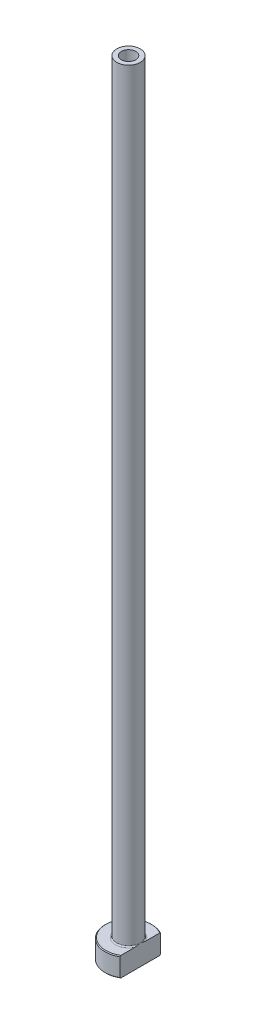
ISO-10303-21;
HEADER;
FILE_DESCRIPTION(('STEP AP214'),'2;1');
FILE_NAME('part.step','',(''),(''),'','','');
FILE_SCHEMA(('AUTOMOTIVE_DESIGN { 1 0 10303 214 1 1 1 1 }'));
ENDSEC;
DATA;
#1=APPLICATION_CONTEXT('core data for automotive mechanical design processes');
#2=APPLICATION_PROTOCOL_DEFINITION('international standard','automotive_design',2000,#1);
#3=PRODUCT_CONTEXT('',#1,'mechanical');
#4=PRODUCT('Part','Part','',(#3));
#5=PRODUCT_RELATED_PRODUCT_CATEGORY('part','',(#4));
#6=PRODUCT_DEFINITION_FORMATION('','',#4);
#7=PRODUCT_DEFINITION_CONTEXT('part definition',#1,'design');
#8=PRODUCT_DEFINITION('design','',#6,#7);
#9=PRODUCT_DEFINITION_SHAPE('','',#8);
#10=(LENGTH_UNIT() NAMED_UNIT(*) SI_UNIT(.MILLI.,.METRE.));
#11=(NAMED_UNIT(*) PLANE_ANGLE_UNIT() SI_UNIT($,.RADIAN.));
#12=(NAMED_UNIT(*) SI_UNIT($,.STERADIAN.) SOLID_ANGLE_UNIT());
#13=UNCERTAINTY_MEASURE_WITH_UNIT(LENGTH_MEASURE(1.E-05),#10,'distance_accuracy_value','');
#14=(GEOMETRIC_REPRESENTATION_CONTEXT(3) GLOBAL_UNCERTAINTY_ASSIGNED_CONTEXT((#13)) GLOBAL_UNIT_ASSIGNED_CONTEXT((#10,
#11,#12)) REPRESENTATION_CONTEXT('',''));
#15=CARTESIAN_POINT('',(0.,0.,0.));
#16=DIRECTION('',(0.,0.,1.));
#17=DIRECTION('',(1.,0.,0.));
#18=AXIS2_PLACEMENT_3D('',#15,#16,#17);
#19=CARTESIAN_POINT('',(0.,92.1876809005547,0.));
#20=DIRECTION('',(0.,1.,0.));
#21=DIRECTION('',(0.,0.,1.));
#22=AXIS2_PLACEMENT_3D('',#19,#20,#21);
#23=CYLINDRICAL_SURFACE('',#22,1.85);
#24=CARTESIAN_POINT('',(0.,200.,0.));
#25=DIRECTION('',(0.,1.,0.));
#26=DIRECTION('',(0.,0.,1.));
#27=AXIS2_PLACEMENT_3D('',#24,#25,#26);
#28=CIRCLE('',#27,1.85);
#29=CARTESIAN_POINT('',(0.,200.,1.85));
#30=VERTEX_POINT('',#29);
#31=EDGE_CURVE('E167',#30,#30,#28,.T.);
#32=ORIENTED_EDGE('',*,*,#31,.T.);
#33=EDGE_LOOP('',(#32));
#34=FACE_BOUND('',#33,.T.);
#35=CARTESIAN_POINT('',(0.,155.,0.));
#36=DIRECTION('',(0.,1.,0.));
#37=DIRECTION('',(0.,0.,1.));
#38=AXIS2_PLACEMENT_3D('',#35,#36,#37);
#39=CIRCLE('',#38,1.85);
#40=CARTESIAN_POINT('',(0.,155.,1.85));
#41=VERTEX_POINT('',#40);
#42=EDGE_CURVE('E170',#41,#41,#39,.T.);
#43=ORIENTED_EDGE('',*,*,#42,.F.);
#44=EDGE_LOOP('',(#43));
#45=FACE_BOUND('',#44,.T.);
#46=ADVANCED_FACE('F32',(#34,#45),#23,.F.);
#47=CARTESIAN_POINT('',(-1.85,200.,0.));
#48=DIRECTION('',(0.,1.,0.));
#49=DIRECTION('',(0.,0.,1.));
#50=AXIS2_PLACEMENT_3D('',#47,#48,#49);
#51=PLANE('',#50);
#52=CARTESIAN_POINT('',(0.,200.,0.));
#53=DIRECTION('',(0.,1.,0.));
#54=DIRECTION('',(0.,0.,1.));
#55=AXIS2_PLACEMENT_3D('',#52,#53,#54);
#56=CIRCLE('',#55,3.00000000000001);
#57=CARTESIAN_POINT('',(0.,200.,3.00000000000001));
#58=VERTEX_POINT('',#57);
#59=EDGE_CURVE('E174',#58,#58,#56,.T.);
#60=ORIENTED_EDGE('',*,*,#59,.T.);
#61=EDGE_LOOP('',(#60));
#62=FACE_BOUND('',#61,.T.);
#63=ORIENTED_EDGE('',*,*,#31,.F.);
#64=EDGE_LOOP('',(#63));
#65=FACE_BOUND('',#64,.T.);
#66=ADVANCED_FACE('F157',(#62,#65),#51,.T.);
#67=CARTESIAN_POINT('',(0.,92.1876809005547,0.));
#68=DIRECTION('',(0.,1.,0.));
#69=DIRECTION('',(0.,0.,1.));
#70=AXIS2_PLACEMENT_3D('',#67,#68,#69);
#71=CYLINDRICAL_SURFACE('',#70,3.);
#72=CARTESIAN_POINT('',(0.,5.3,0.));
#73=DIRECTION('',(0.,1.,0.));
#74=DIRECTION('',(0.,0.,1.));
#75=AXIS2_PLACEMENT_3D('',#72,#73,#74);
#76=CIRCLE('',#75,3.);
#77=CARTESIAN_POINT('',(3.,5.3,0.));
#78=VERTEX_POINT('',#77);
#79=EDGE_CURVE('E180',#78,#78,#76,.T.);
#80=ORIENTED_EDGE('',*,*,#79,.T.);
#81=EDGE_LOOP('',(#80));
#82=FACE_BOUND('',#81,.T.);
#83=ORIENTED_EDGE('',*,*,#59,.F.);
#84=EDGE_LOOP('',(#83));
#85=FACE_BOUND('',#84,.T.);
#86=ADVANCED_FACE('F162',(#82,#85),#71,.T.);
#87=CARTESIAN_POINT('',(-2.99999999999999,5.,0.));
#88=DIRECTION('',(0.,1.,0.));
#89=DIRECTION('',(0.,0.,1.));
#90=AXIS2_PLACEMENT_3D('',#87,#88,#89);
#91=PLANE('',#90);
#92=DIRECTION('',(0.,0.,1.));
#93=VECTOR('',#92,1.);
#94=CARTESIAN_POINT('',(2.99999999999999,5.,0.));
#95=LINE('',#94,#93);
#96=CARTESIAN_POINT('',(3.,5.,-4.96386945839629));
#97=VERTEX_POINT('',#96);
#98=CARTESIAN_POINT('',(2.99999999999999,5.,-1.37477270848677));
#99=VERTEX_POINT('',#98);
#100=EDGE_CURVE('E54',#97,#99,#95,.T.);
#101=ORIENTED_EDGE('',*,*,#100,.F.);
#102=CARTESIAN_POINT('',(0.,5.,0.));
#103=DIRECTION('',(0.,1.,0.));
#104=DIRECTION('',(0.,0.,1.));
#105=AXIS2_PLACEMENT_3D('',#102,#103,#104);
#106=CIRCLE('',#105,5.79999999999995);
#107=CARTESIAN_POINT('',(2.99999999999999,5.,4.96386945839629));
#108=VERTEX_POINT('',#107);
#109=EDGE_CURVE('E186',#97,#108,#106,.T.);
#110=ORIENTED_EDGE('',*,*,#109,.T.);
#111=CARTESIAN_POINT('',(2.99999999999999,5.,1.37477270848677));
#112=VERTEX_POINT('',#111);
#113=EDGE_CURVE('E134',#112,#108,#95,.T.);
#114=ORIENTED_EDGE('',*,*,#113,.F.);
#115=CARTESIAN_POINT('',(0.,5.,0.));
#116=DIRECTION('',(0.,1.,0.));
#117=DIRECTION('',(0.,0.,1.));
#118=AXIS2_PLACEMENT_3D('',#115,#116,#117);
#119=CIRCLE('',#118,3.3);
#120=EDGE_CURVE('E183',#112,#99,#119,.F.);
#121=ORIENTED_EDGE('',*,*,#120,.T.);
#122=EDGE_LOOP('',(#101,#110,#114,#121));
#123=FACE_BOUND('',#122,.T.);
#124=ADVANCED_FACE('F197',(#123),#91,.T.);
#125=CARTESIAN_POINT('',(0.,92.1876809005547,0.));
#126=DIRECTION('',(0.,1.,0.));
#127=DIRECTION('',(0.,0.,1.));
#128=AXIS2_PLACEMENT_3D('',#125,#126,#127);
#129=CYLINDRICAL_SURFACE('',#128,5.99999999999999);
#130=DIRECTION('',(0.,-1.,0.));
#131=VECTOR('',#130,1.);
#132=CARTESIAN_POINT('',(2.99999999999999,200.,5.19615242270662));
#133=LINE('',#132,#131);
#134=CARTESIAN_POINT('',(2.99999999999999,4.79999999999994,5.19615242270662));
#135=VERTEX_POINT('',#134);
#136=CARTESIAN_POINT('',(2.99999999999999,0.20000000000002,5.19615242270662));
#137=VERTEX_POINT('',#136);
#138=EDGE_CURVE('E82',#135,#137,#133,.T.);
#139=ORIENTED_EDGE('',*,*,#138,.F.);
#140=CARTESIAN_POINT('',(0.,4.79999999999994,0.));
#141=DIRECTION('',(0.,1.,0.));
#142=DIRECTION('',(0.,0.,1.));
#143=AXIS2_PLACEMENT_3D('',#140,#141,#142);
#144=CIRCLE('',#143,5.99999999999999);
#145=CARTESIAN_POINT('',(3.,4.79999999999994,-5.19615242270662));
#146=VERTEX_POINT('',#145);
#147=EDGE_CURVE('E95',#135,#146,#144,.F.);
#148=ORIENTED_EDGE('',*,*,#147,.T.);
#149=DIRECTION('',(0.,-1.,0.));
#150=VECTOR('',#149,1.);
#151=CARTESIAN_POINT('',(3.,200.,-5.19615242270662));
#152=LINE('',#151,#150);
#153=CARTESIAN_POINT('',(3.,0.20000000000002,-5.19615242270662));
#154=VERTEX_POINT('',#153);
#155=EDGE_CURVE('E192',#146,#154,#152,.T.);
#156=ORIENTED_EDGE('',*,*,#155,.T.);
#157=CARTESIAN_POINT('',(0.,0.20000000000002,0.));
#158=DIRECTION('',(0.,-1.,0.));
#159=DIRECTION('',(0.,0.,-1.));
#160=AXIS2_PLACEMENT_3D('',#157,#158,#159);
#161=CIRCLE('',#160,5.99999999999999);
#162=EDGE_CURVE('E98',#154,#137,#161,.F.);
#163=ORIENTED_EDGE('',*,*,#162,.T.);
#164=EDGE_LOOP('',(#139,#148,#156,#163));
#165=FACE_BOUND('',#164,.T.);
#166=ADVANCED_FACE('F190',(#165),#129,.T.);
#167=CARTESIAN_POINT('',(-5.99999999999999,0.,0.));
#168=DIRECTION('',(0.,-1.,0.));
#169=DIRECTION('',(0.,0.,-1.));
#170=AXIS2_PLACEMENT_3D('',#167,#168,#169);
#171=PLANE('',#170);
#172=CARTESIAN_POINT('',(0.,0.,0.));
#173=DIRECTION('',(0.,-1.,0.));
#174=DIRECTION('',(0.,0.,-1.));
#175=AXIS2_PLACEMENT_3D('',#172,#173,#174);
#176=CIRCLE('',#175,2.59999999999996);
#177=CARTESIAN_POINT('',(0.,0.,-2.59999999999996));
#178=VERTEX_POINT('',#177);
#179=EDGE_CURVE('E40',#178,#178,#176,.F.);
#180=ORIENTED_EDGE('',*,*,#179,.T.);
#181=EDGE_LOOP('',(#180));
#182=FACE_BOUND('',#181,.T.);
#183=DIRECTION('',(0.,0.,-1.));
#184=VECTOR('',#183,1.);
#185=CARTESIAN_POINT('',(2.99999999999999,0.,5.19615242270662));
#186=LINE('',#185,#184);
#187=CARTESIAN_POINT('',(2.99999999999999,0.,4.96386945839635));
#188=VERTEX_POINT('',#187);
#189=CARTESIAN_POINT('',(3.,0.,-4.96386945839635));
#190=VERTEX_POINT('',#189);
#191=EDGE_CURVE('E47',#188,#190,#186,.T.);
#192=ORIENTED_EDGE('',*,*,#191,.F.);
#193=CARTESIAN_POINT('',(0.,0.,0.));
#194=DIRECTION('',(0.,-1.,0.));
#195=DIRECTION('',(0.,0.,-1.));
#196=AXIS2_PLACEMENT_3D('',#193,#194,#195);
#197=CIRCLE('',#196,5.8);
#198=EDGE_CURVE('E92',#188,#190,#197,.T.);
#199=ORIENTED_EDGE('',*,*,#198,.T.);
#200=EDGE_LOOP('',(#192,#199));
#201=FACE_BOUND('',#200,.T.);
#202=ADVANCED_FACE('F91',(#182,#201),#171,.T.);
#203=CARTESIAN_POINT('',(0.,92.1876809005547,0.));
#204=DIRECTION('',(0.,1.,0.));
#205=DIRECTION('',(0.,0.,1.));
#206=AXIS2_PLACEMENT_3D('',#203,#204,#205);
#207=CYLINDRICAL_SURFACE('',#206,2.1);
#208=CARTESIAN_POINT('',(0.,0.499999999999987,0.));
#209=DIRECTION('',(0.,-1.,0.));
#210=DIRECTION('',(0.,0.,-1.));
#211=AXIS2_PLACEMENT_3D('',#208,#209,#210);
#212=CIRCLE('',#211,2.1);
#213=CARTESIAN_POINT('',(0.,0.499999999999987,-2.1));
#214=VERTEX_POINT('',#213);
#215=EDGE_CURVE('E11',#214,#214,#212,.T.);
#216=ORIENTED_EDGE('',*,*,#215,.T.);
#217=EDGE_LOOP('',(#216));
#218=FACE_BOUND('',#217,.T.);
#219=CARTESIAN_POINT('',(0.,143.,0.));
#220=DIRECTION('',(0.,1.,0.));
#221=DIRECTION('',(0.,0.,1.));
#222=AXIS2_PLACEMENT_3D('',#219,#220,#221);
#223=CIRCLE('',#222,2.10000000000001);
#224=CARTESIAN_POINT('',(0.,143.,2.10000000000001));
#225=VERTEX_POINT('',#224);
#226=EDGE_CURVE('E172',#225,#225,#223,.T.);
#227=ORIENTED_EDGE('',*,*,#226,.T.);
#228=EDGE_LOOP('',(#227));
#229=FACE_BOUND('',#228,.T.);
#230=ADVANCED_FACE('F215',(#218,#229),#207,.F.);
#231=CARTESIAN_POINT('',(0.,143.,0.));
#232=DIRECTION('',(0.,-1.,0.));
#233=DIRECTION('',(0.,0.,-1.));
#234=AXIS2_PLACEMENT_3D('',#231,#232,#233);
#235=CONICAL_SURFACE('',#234,2.10000000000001,0.0208303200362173);
#236=ORIENTED_EDGE('',*,*,#42,.T.);
#237=EDGE_LOOP('',(#236));
#238=FACE_BOUND('',#237,.T.);
#239=ORIENTED_EDGE('',*,*,#226,.F.);
#240=EDGE_LOOP('',(#239));
#241=FACE_BOUND('',#240,.T.);
#242=ADVANCED_FACE('F111',(#238,#241),#235,.F.);
#243=CARTESIAN_POINT('',(0.,5.3,0.));
#244=DIRECTION('',(0.,1.,0.));
#245=DIRECTION('',(0.,0.,1.));
#246=AXIS2_PLACEMENT_3D('',#243,#244,#245);
#247=TOROIDAL_SURFACE('',#246,3.3,0.3);
#248=ORIENTED_EDGE('',*,*,#120,.F.);
#249=CARTESIAN_POINT('',(3.,5.3,0.));
#250=CARTESIAN_POINT('',(3.,5.30000062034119,-1.12611837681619E-10));
#251=CARTESIAN_POINT('',(3.,5.30000124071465,1.7970684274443E-07));
#252=CARTESIAN_POINT('',(3.,5.30000241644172,7.12597634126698E-07));
#253=CARTESIAN_POINT('',(3.,5.30000296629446,1.07470919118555E-06));
#254=CARTESIAN_POINT('',(3.,5.30000408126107,1.93940838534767E-06));
#255=CARTESIAN_POINT('',(3.,5.30000463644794,2.45488632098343E-06));
#256=CARTESIAN_POINT('',(3.,5.30000565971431,3.54465568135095E-06));
#257=CARTESIAN_POINT('',(3.,5.30000612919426,4.11770712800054E-06));
#258=CARTESIAN_POINT('',(3.,5.30000778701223,6.25396510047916E-06));
#259=CARTESIAN_POINT('',(3.,5.30000888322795,7.89070925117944E-06));
#260=CARTESIAN_POINT('',(3.,5.30001076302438,1.11998061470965E-05));
#261=CARTESIAN_POINT('',(3.,5.30001156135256,1.28642120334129E-05));
#262=CARTESIAN_POINT('',(3.,5.30001474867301,1.96537185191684E-05));
#263=CARTESIAN_POINT('',(3.,5.30001702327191,2.48380256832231E-05));
#264=CARTESIAN_POINT('',(3.,5.30002052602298,3.48178503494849E-05));
#265=CARTESIAN_POINT('',(3.,5.30002184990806,3.95800645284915E-05));
#266=CARTESIAN_POINT('',(2.99999999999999,5.3000312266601,7.41814409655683E-05));
#267=CARTESIAN_POINT('',(2.99999999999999,5.30003808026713,0.000104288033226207));
#268=CARTESIAN_POINT('',(3.,5.30006804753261,0.00022223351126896));
#269=CARTESIAN_POINT('',(2.99999999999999,5.30009687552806,0.000308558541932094));
#270=CARTESIAN_POINT('',(2.99999999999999,5.30020809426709,0.000648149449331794));
#271=CARTESIAN_POINT('',(2.99999999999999,5.30028657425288,0.000902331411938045));
#272=CARTESIAN_POINT('',(3.,5.30059876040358,0.00190491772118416));
#273=CARTESIAN_POINT('',(2.99999999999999,5.30083723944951,0.00265218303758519));
#274=CARTESIAN_POINT('',(2.99999999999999,5.30182192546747,0.00574694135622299));
#275=CARTESIAN_POINT('',(2.99999999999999,5.30256224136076,0.00809584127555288));
#276=CARTESIAN_POINT('',(3.,5.31160267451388,0.0367678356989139));
#277=CARTESIAN_POINT('',(3.,5.31993817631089,0.0630827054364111));
#278=CARTESIAN_POINT('',(2.99999999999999,5.33621504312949,0.114704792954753));
#279=CARTESIAN_POINT('',(2.99999999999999,5.34415908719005,0.140011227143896));
#280=CARTESIAN_POINT('',(3.,5.3609438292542,0.193774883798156));
#281=CARTESIAN_POINT('',(2.99999999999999,5.36977415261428,0.222235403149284));
#282=CARTESIAN_POINT('',(2.99999999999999,5.38736474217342,0.27951240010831));
#283=CARTESIAN_POINT('',(2.99999999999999,5.39612323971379,0.308329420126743));
#284=CARTESIAN_POINT('',(2.99999999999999,5.41726575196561,0.378880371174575));
#285=CARTESIAN_POINT('',(2.99999999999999,5.42952723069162,0.420651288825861));
#286=CARTESIAN_POINT('',(2.99999999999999,5.4530959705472,0.503357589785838));
#287=CARTESIAN_POINT('',(2.99999999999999,5.46441924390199,0.544288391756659));
#288=CARTESIAN_POINT('',(2.99999999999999,5.48778169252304,0.63215617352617));
#289=CARTESIAN_POINT('',(2.99999999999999,5.49969678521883,0.679126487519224));
#290=CARTESIAN_POINT('',(2.99999999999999,5.52221484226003,0.77374095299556));
#291=CARTESIAN_POINT('',(2.99999999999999,5.53280772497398,0.821387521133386));
#292=CARTESIAN_POINT('',(2.99999999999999,5.55291503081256,0.920589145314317));
#293=CARTESIAN_POINT('',(2.99999999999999,5.56229188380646,0.972172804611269));
#294=CARTESIAN_POINT('',(2.99999999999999,5.57838694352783,1.07574836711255));
#295=CARTESIAN_POINT('',(2.99999999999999,5.585105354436,1.12774023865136));
#296=CARTESIAN_POINT('',(2.99999999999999,5.59681427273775,1.24924411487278));
#297=CARTESIAN_POINT('',(2.99999999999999,5.60051317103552,1.31890364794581));
#298=CARTESIAN_POINT('',(2.99999999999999,5.59966579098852,1.42270835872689));
#299=CARTESIAN_POINT('',(2.99999999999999,5.59835823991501,1.45688093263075));
#300=CARTESIAN_POINT('',(2.99999999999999,5.59322745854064,1.52502533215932));
#301=CARTESIAN_POINT('',(2.99999999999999,5.58940645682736,1.55899730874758));
#302=CARTESIAN_POINT('',(2.99999999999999,5.57976146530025,1.61947815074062));
#303=CARTESIAN_POINT('',(2.99999999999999,5.57451506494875,1.64607760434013));
#304=CARTESIAN_POINT('',(2.99999999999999,5.56161153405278,1.69883648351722));
#305=CARTESIAN_POINT('',(2.99999999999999,5.55394338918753,1.72499331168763));
#306=CARTESIAN_POINT('',(2.99999999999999,5.53555176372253,1.77650913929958));
#307=CARTESIAN_POINT('',(2.99999999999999,5.52480031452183,1.80185836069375));
#308=CARTESIAN_POINT('',(2.99999999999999,5.49948027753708,1.85054545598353));
#309=CARTESIAN_POINT('',(2.99999999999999,5.48493141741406,1.87389291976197));
#310=CARTESIAN_POINT('',(2.99999999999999,5.45992470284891,1.90552135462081));
#311=CARTESIAN_POINT('',(2.99999999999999,5.45133318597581,1.91527363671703));
#312=CARTESIAN_POINT('',(2.99999999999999,5.43294163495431,1.93360072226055));
#313=CARTESIAN_POINT('',(2.99999999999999,5.42314083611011,1.94217477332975));
#314=CARTESIAN_POINT('',(2.99999999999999,5.4021589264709,1.95778354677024));
#315=CARTESIAN_POINT('',(2.99999999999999,5.39096156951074,1.96479687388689));
#316=CARTESIAN_POINT('',(2.99999999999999,5.36742144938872,1.97652218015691));
#317=CARTESIAN_POINT('',(2.99999999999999,5.35508207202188,1.98124071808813));
#318=CARTESIAN_POINT('',(2.99999999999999,5.33320117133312,1.98690185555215));
#319=CARTESIAN_POINT('',(2.99999999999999,5.32383559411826,1.98852953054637));
#320=CARTESIAN_POINT('',(2.99999999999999,5.30496375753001,1.99016898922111));
#321=CARTESIAN_POINT('',(2.99999999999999,5.29545756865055,1.99018155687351));
#322=CARTESIAN_POINT('',(2.99999999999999,5.2765931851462,1.98858978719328));
#323=CARTESIAN_POINT('',(2.99999999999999,5.26723486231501,1.98698693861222));
#324=CARTESIAN_POINT('',(2.99999999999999,5.24889957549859,1.98229727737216));
#325=CARTESIAN_POINT('',(2.99999999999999,5.23992286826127,1.97920948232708));
#326=CARTESIAN_POINT('',(2.99999999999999,5.2198129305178,1.97059641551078));
#327=CARTESIAN_POINT('',(2.99999999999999,5.2088771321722,1.96461176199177));
#328=CARTESIAN_POINT('',(2.99999999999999,5.18811536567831,1.9509572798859));
#329=CARTESIAN_POINT('',(2.99999999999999,5.1782917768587,1.94328393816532));
#330=CARTESIAN_POINT('',(2.99999999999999,5.15512177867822,1.92254223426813));
#331=CARTESIAN_POINT('',(2.99999999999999,5.1424756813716,1.9086968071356));
#332=CARTESIAN_POINT('',(2.99999999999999,5.11944595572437,1.87927587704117));
#333=CARTESIAN_POINT('',(2.99999999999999,5.10906527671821,1.86369815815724));
#334=CARTESIAN_POINT('',(2.99999999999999,5.0830960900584,1.81927355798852));
#335=CARTESIAN_POINT('',(2.99999999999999,5.06948546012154,1.78928084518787));
#336=CARTESIAN_POINT('',(2.99999999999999,5.04658664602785,1.72751962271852));
#337=CARTESIAN_POINT('',(2.99999999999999,5.03733582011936,1.69573828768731));
#338=CARTESIAN_POINT('',(2.99999999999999,5.0221431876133,1.630799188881));
#339=CARTESIAN_POINT('',(2.99999999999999,5.01626537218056,1.59762686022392));
#340=CARTESIAN_POINT('',(2.99999999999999,5.00734002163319,1.53086029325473));
#341=CARTESIAN_POINT('',(2.99999999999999,5.00429797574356,1.49726536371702));
#342=CARTESIAN_POINT('',(2.99999999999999,5.00059037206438,1.43100872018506));
#343=CARTESIAN_POINT('',(2.99999999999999,4.99985343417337,1.39835069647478));
#344=CARTESIAN_POINT('',(2.99999999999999,5.00019322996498,1.33318312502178));
#345=CARTESIAN_POINT('',(2.99999999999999,5.00126261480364,1.3006735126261));
#346=CARTESIAN_POINT('',(2.99999999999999,5.00569854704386,1.22190465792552));
#347=CARTESIAN_POINT('',(2.99999999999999,5.00984986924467,1.1756903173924));
#348=CARTESIAN_POINT('',(2.99999999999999,5.02060876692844,1.08357061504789));
#349=CARTESIAN_POINT('',(2.99999999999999,5.02721586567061,1.03766519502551));
#350=CARTESIAN_POINT('',(2.99999999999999,5.0425809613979,0.945130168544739));
#351=CARTESIAN_POINT('',(2.99999999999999,5.05138514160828,0.898508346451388));
#352=CARTESIAN_POINT('',(2.99999999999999,5.07066869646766,0.805496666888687));
#353=CARTESIAN_POINT('',(2.99999999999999,5.08115218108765,0.759107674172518));
#354=CARTESIAN_POINT('',(2.99999999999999,5.10738921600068,0.650207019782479));
#355=CARTESIAN_POINT('',(2.99999999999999,5.12369110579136,0.58782843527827));
#356=CARTESIAN_POINT('',(2.99999999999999,5.15777680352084,0.464212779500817));
#357=CARTESIAN_POINT('',(2.99999999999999,5.1755426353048,0.402970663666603));
#358=CARTESIAN_POINT('',(2.99999999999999,5.2100672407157,0.287596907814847));
#359=CARTESIAN_POINT('',(3.,5.22671796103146,0.233432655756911));
#360=CARTESIAN_POINT('',(2.99999999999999,5.25241226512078,0.150940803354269));
#361=CARTESIAN_POINT('',(2.99999999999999,5.2613106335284,0.122567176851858));
#362=CARTESIAN_POINT('',(3.,5.2790517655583,0.0662804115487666));
#363=CARTESIAN_POINT('',(3.,5.28789327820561,0.038366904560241));
#364=CARTESIAN_POINT('',(2.99999999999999,5.29743877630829,0.0080925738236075));
#365=CARTESIAN_POINT('',(2.99999999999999,5.29818012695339,0.00574041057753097));
#366=CARTESIAN_POINT('',(2.99999999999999,5.2991650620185,0.00264489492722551));
#367=CARTESIAN_POINT('',(3.,5.29940274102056,0.00190013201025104));
#368=CARTESIAN_POINT('',(2.99999999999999,5.29971394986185,0.000900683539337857));
#369=CARTESIAN_POINT('',(2.99999999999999,5.29979223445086,0.000647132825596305));
#370=CARTESIAN_POINT('',(2.99999999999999,5.29990321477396,0.000308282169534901));
#371=CARTESIAN_POINT('',(3.,5.29993200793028,0.000222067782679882));
#372=CARTESIAN_POINT('',(2.99999999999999,5.29996194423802,0.000104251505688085));
#373=CARTESIAN_POINT('',(2.99999999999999,5.29996879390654,7.41614246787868E-05));
#374=CARTESIAN_POINT('',(3.,5.29997816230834,3.95766708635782E-05));
#375=CARTESIAN_POINT('',(3.,5.29997948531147,3.48154668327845E-05));
#376=CARTESIAN_POINT('',(3.,5.29998298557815,2.48376281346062E-05));
#377=CARTESIAN_POINT('',(3.,5.29998525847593,1.96542453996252E-05));
#378=CARTESIAN_POINT('',(3.,5.2999884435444,1.28656655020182E-05));
#379=CARTESIAN_POINT('',(3.,5.29998924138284,1.12013349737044E-05));
#380=CARTESIAN_POINT('',(3.,5.2999911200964,7.89230029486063E-06));
#381=CARTESIAN_POINT('',(3.,5.29999221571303,6.25553534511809E-06));
#382=CARTESIAN_POINT('',(3.,5.29999387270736,4.11914367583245E-06));
#383=CARTESIAN_POINT('',(3.,5.29999434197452,3.54603094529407E-06));
#384=CARTESIAN_POINT('',(3.,5.29999536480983,2.45610068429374E-06));
#385=CARTESIAN_POINT('',(3.,5.29999591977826,1.94052228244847E-06));
#386=CARTESIAN_POINT('',(3.,5.29999703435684,1.07558323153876E-06));
#387=CARTESIAN_POINT('',(3.,5.29999758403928,7.13339443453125E-07));
#388=CARTESIAN_POINT('',(3.,5.29999875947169,1.80121939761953E-07));
#389=CARTESIAN_POINT('',(3.,5.29999937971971,1.12601282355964E-10));
#390=CARTESIAN_POINT('',(3.,5.3,0.));
#391=B_SPLINE_CURVE_WITH_KNOTS('',3,(#249,#250,#251,#252,#253,#254,#255,#256,#257,#258,#259,
#260,#261,#262,#263,#264,#265,#266,#267,#268,#269,#270,#271,#272,#273,#274,#275,#276,#277,#278,
#279,#280,#281,#282,#283,#284,#285,#286,#287,#288,#289,#290,#291,#292,#293,#294,#295,#296,#297,
#298,#299,#300,#301,#302,#303,#304,#305,#306,#307,#308,#309,#310,#311,#312,#313,#314,#315,#316,
#317,#318,#319,#320,#321,#322,#323,#324,#325,#326,#327,#328,#329,#330,#331,#332,#333,#334,#335,
#336,#337,#338,#339,#340,#341,#342,#343,#344,#345,#346,#347,#348,#349,#350,#351,#352,#353,#354,
#355,#356,#357,#358,#359,#360,#361,#362,#363,#364,#365,#366,#367,#368,#369,#370,#371,#372,#373,
#374,#375,#376,#377,#378,#379,#380,#381,#382,#383,#384,#385,#386,#387,#388,#389,#390),
.UNSPECIFIED.,.T.,.F.,(4,2,2,2,2,2,2,2,2,2,2,2,2,2,2,2,2,2,2,2,2,2,2,2,2,2,2,2,2,2,2,2,2,2,2,2,
2,2,2,2,2,2,2,2,2,2,2,2,2,2,2,2,2,2,2,2,2,2,2,2,2,2,2,2,2,2,2,2,2,2,4),(0.,1.8651383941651E-06,
3.83353199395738E-06,6.09513173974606E-06,8.31560460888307E-06,1.42000689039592E-05,
1.97335486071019E-05,3.66769850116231E-05,5.14858298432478E-05,0.000144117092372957,
0.000416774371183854,0.00121521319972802,0.00356794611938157,0.0109568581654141,
0.0937636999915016,0.173336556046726,0.262732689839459,0.353088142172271,0.483684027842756,
0.611082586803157,0.756439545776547,0.902844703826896,1.06007042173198,1.2172840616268,
1.42611662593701,1.52864191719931,1.63107642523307,1.71232857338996,1.79395571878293,
1.87634808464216,1.95832065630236,1.99722769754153,2.03615946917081,2.07559591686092,
2.11491897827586,2.14330913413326,2.17168550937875,2.20003575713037,2.22840478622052,
2.26559554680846,2.30286442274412,2.3588021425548,2.41481225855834,2.5130700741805,
2.61215518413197,2.71306273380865,2.81416520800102,2.91210427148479,3.00964583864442,
3.14875779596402,3.28784276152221,3.43014232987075,3.57279564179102,3.76617940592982,
3.95746724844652,4.12746077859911,4.21667041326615,4.30450746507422,4.31190664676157,
4.31425150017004,4.31504795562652,4.31532026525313,4.31541284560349,4.31542765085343,
4.3154445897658,4.31545012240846,4.31545600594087,4.31545822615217,4.3154604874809,
4.31546245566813,4.31546432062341),.UNSPECIFIED.);
#392=EDGE_CURVE('E126',#112,#78,#391,.T.);
#393=ORIENTED_EDGE('',*,*,#392,.T.);
#394=ORIENTED_EDGE('',*,*,#79,.F.);
#395=CARTESIAN_POINT('',(3.,5.3,0.));
#396=CARTESIAN_POINT('',(3.,5.29999937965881,1.12612407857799E-10));
#397=CARTESIAN_POINT('',(3.,5.29999875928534,-1.7970684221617E-07));
#398=CARTESIAN_POINT('',(3.,5.29999758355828,-7.12597633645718E-07));
#399=CARTESIAN_POINT('',(3.,5.29999703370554,-1.07470919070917E-06));
#400=CARTESIAN_POINT('',(3.,5.29999591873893,-1.93940838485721E-06));
#401=CARTESIAN_POINT('',(3.,5.29999536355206,-2.45488632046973E-06));
#402=CARTESIAN_POINT('',(3.,5.29999434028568,-3.54465568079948E-06));
#403=CARTESIAN_POINT('',(3.,5.29999387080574,-4.11770712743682E-06));
#404=CARTESIAN_POINT('',(3.,5.29999221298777,-6.25396509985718E-06));
#405=CARTESIAN_POINT('',(3.,5.29999111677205,-7.89070925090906E-06));
#406=CARTESIAN_POINT('',(3.,5.29998923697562,-1.11998061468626E-05));
#407=CARTESIAN_POINT('',(3.,5.29998843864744,-1.28642120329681E-05));
#408=CARTESIAN_POINT('',(3.,5.29998525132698,-1.96537185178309E-05));
#409=CARTESIAN_POINT('',(3.,5.29998297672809,-2.4838025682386E-05));
#410=CARTESIAN_POINT('',(3.,5.29997947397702,-3.48178503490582E-05));
#411=CARTESIAN_POINT('',(3.,5.29997815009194,-3.95800645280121E-05));
#412=CARTESIAN_POINT('',(2.99999999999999,5.2999687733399,-7.41814409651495E-05));
#413=CARTESIAN_POINT('',(2.99999999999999,5.29996191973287,-0.000104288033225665));
#414=CARTESIAN_POINT('',(3.,5.29993195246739,-0.000222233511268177));
#415=CARTESIAN_POINT('',(2.99999999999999,5.29990312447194,-0.000308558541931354));
#416=CARTESIAN_POINT('',(2.99999999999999,5.29979190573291,-0.000648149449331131));
#417=CARTESIAN_POINT('',(2.99999999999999,5.29971342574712,-0.00090233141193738));
#418=CARTESIAN_POINT('',(3.,5.29940123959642,-0.00190491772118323));
#419=CARTESIAN_POINT('',(2.99999999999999,5.29916276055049,-0.00265218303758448));
#420=CARTESIAN_POINT('',(2.99999999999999,5.29817807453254,-0.00574694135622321));
#421=CARTESIAN_POINT('',(2.99999999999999,5.29743775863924,-0.00809584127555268));
#422=CARTESIAN_POINT('',(3.,5.2883973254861,-0.0367678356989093));
#423=CARTESIAN_POINT('',(3.,5.2800618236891,-0.0630827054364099));
#424=CARTESIAN_POINT('',(2.99999999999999,5.26378495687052,-0.114704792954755));
#425=CARTESIAN_POINT('',(2.99999999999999,5.25584091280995,-0.140011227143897));
#426=CARTESIAN_POINT('',(3.,5.23905617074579,-0.193774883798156));
#427=CARTESIAN_POINT('',(2.99999999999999,5.23022584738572,-0.222235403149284));
#428=CARTESIAN_POINT('',(2.99999999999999,5.21263525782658,-0.27951240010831));
#429=CARTESIAN_POINT('',(2.99999999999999,5.2038767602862,-0.308329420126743));
#430=CARTESIAN_POINT('',(2.99999999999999,5.18273424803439,-0.378880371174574));
#431=CARTESIAN_POINT('',(2.99999999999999,5.17047276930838,-0.42065128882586));
#432=CARTESIAN_POINT('',(2.99999999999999,5.1469040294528,-0.503357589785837));
#433=CARTESIAN_POINT('',(2.99999999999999,5.13558075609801,-0.544288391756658));
#434=CARTESIAN_POINT('',(2.99999999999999,5.11221830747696,-0.63215617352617));
#435=CARTESIAN_POINT('',(2.99999999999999,5.10030321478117,-0.679126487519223));
#436=CARTESIAN_POINT('',(2.99999999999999,5.07778515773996,-0.773740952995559));
#437=CARTESIAN_POINT('',(2.99999999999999,5.06719227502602,-0.821387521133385));
#438=CARTESIAN_POINT('',(2.99999999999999,5.04708496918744,-0.920589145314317));
#439=CARTESIAN_POINT('',(2.99999999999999,5.03770811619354,-0.972172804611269));
#440=CARTESIAN_POINT('',(2.99999999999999,5.02161305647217,-1.07574836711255));
#441=CARTESIAN_POINT('',(2.99999999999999,5.014894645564,-1.12774023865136));
#442=CARTESIAN_POINT('',(2.99999999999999,5.00318572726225,-1.24924411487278));
#443=CARTESIAN_POINT('',(2.99999999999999,4.99948682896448,-1.31890364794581));
#444=CARTESIAN_POINT('',(2.99999999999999,5.00033420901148,-1.42270835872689));
#445=CARTESIAN_POINT('',(2.99999999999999,5.00164176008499,-1.45688093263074));
#446=CARTESIAN_POINT('',(2.99999999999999,5.00677254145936,-1.52502533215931));
#447=CARTESIAN_POINT('',(2.99999999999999,5.01059354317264,-1.55899730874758));
#448=CARTESIAN_POINT('',(2.99999999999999,5.02023853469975,-1.61947815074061));
#449=CARTESIAN_POINT('',(2.99999999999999,5.02548493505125,-1.64607760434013));
#450=CARTESIAN_POINT('',(2.99999999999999,5.03838846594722,-1.69883648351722));
#451=CARTESIAN_POINT('',(2.99999999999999,5.04605661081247,-1.72499331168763));
#452=CARTESIAN_POINT('',(2.99999999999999,5.06444823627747,-1.77650913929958));
#453=CARTESIAN_POINT('',(2.99999999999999,5.07519968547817,-1.80185836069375));
#454=CARTESIAN_POINT('',(2.99999999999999,5.10051972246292,-1.85054545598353));
#455=CARTESIAN_POINT('',(2.99999999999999,5.11506858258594,-1.87389291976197));
#456=CARTESIAN_POINT('',(2.99999999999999,5.14007529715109,-1.90552135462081));
#457=CARTESIAN_POINT('',(2.99999999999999,5.14866681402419,-1.91527363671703));
#458=CARTESIAN_POINT('',(2.99999999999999,5.16705836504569,-1.93360072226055));
#459=CARTESIAN_POINT('',(2.99999999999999,5.17685916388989,-1.94217477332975));
#460=CARTESIAN_POINT('',(2.99999999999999,5.1978410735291,-1.95778354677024));
#461=CARTESIAN_POINT('',(2.99999999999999,5.20903843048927,-1.96479687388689));
#462=CARTESIAN_POINT('',(2.99999999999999,5.23257855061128,-1.97652218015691));
#463=CARTESIAN_POINT('',(2.99999999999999,5.24491792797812,-1.98124071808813));
#464=CARTESIAN_POINT('',(2.99999999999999,5.26679882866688,-1.98690185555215));
#465=CARTESIAN_POINT('',(2.99999999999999,5.27616440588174,-1.98852953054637));
#466=CARTESIAN_POINT('',(2.99999999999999,5.29503624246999,-1.99016898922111));
#467=CARTESIAN_POINT('',(2.99999999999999,5.30454243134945,-1.9901815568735));
#468=CARTESIAN_POINT('',(2.99999999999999,5.3234068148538,-1.98858978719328));
#469=CARTESIAN_POINT('',(2.99999999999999,5.33276513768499,-1.98698693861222));
#470=CARTESIAN_POINT('',(2.99999999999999,5.35110042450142,-1.98229727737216));
#471=CARTESIAN_POINT('',(2.99999999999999,5.36007713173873,-1.97920948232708));
#472=CARTESIAN_POINT('',(2.99999999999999,5.3801870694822,-1.97059641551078));
#473=CARTESIAN_POINT('',(2.99999999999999,5.3911228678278,-1.96461176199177));
#474=CARTESIAN_POINT('',(2.99999999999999,5.41188463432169,-1.9509572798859));
#475=CARTESIAN_POINT('',(2.99999999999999,5.4217082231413,-1.94328393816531));
#476=CARTESIAN_POINT('',(2.99999999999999,5.44487822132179,-1.92254223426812));
#477=CARTESIAN_POINT('',(2.99999999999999,5.45752431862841,-1.9086968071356));
#478=CARTESIAN_POINT('',(2.99999999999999,5.48055404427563,-1.87927587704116));
#479=CARTESIAN_POINT('',(2.99999999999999,5.49093472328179,-1.86369815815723));
#480=CARTESIAN_POINT('',(2.99999999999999,5.51690390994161,-1.8192735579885));
#481=CARTESIAN_POINT('',(2.99999999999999,5.53051453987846,-1.78928084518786));
#482=CARTESIAN_POINT('',(2.99999999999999,5.55341335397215,-1.7275196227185));
#483=CARTESIAN_POINT('',(2.99999999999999,5.56266417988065,-1.69573828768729));
#484=CARTESIAN_POINT('',(2.99999999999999,5.57785681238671,-1.63079918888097));
#485=CARTESIAN_POINT('',(2.99999999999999,5.58373462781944,-1.59762686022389));
#486=CARTESIAN_POINT('',(2.99999999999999,5.59265997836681,-1.53086029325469));
#487=CARTESIAN_POINT('',(2.99999999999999,5.59570202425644,-1.49726536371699));
#488=CARTESIAN_POINT('',(2.99999999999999,5.59940962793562,-1.43100872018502));
#489=CARTESIAN_POINT('',(2.99999999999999,5.60014656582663,-1.39835069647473));
#490=CARTESIAN_POINT('',(2.99999999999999,5.59980677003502,-1.33318312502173));
#491=CARTESIAN_POINT('',(2.99999999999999,5.59873738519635,-1.30067351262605));
#492=CARTESIAN_POINT('',(2.99999999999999,5.59430145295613,-1.22190465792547));
#493=CARTESIAN_POINT('',(2.99999999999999,5.59015013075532,-1.17569031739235));
#494=CARTESIAN_POINT('',(2.99999999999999,5.57939123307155,-1.08357061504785));
#495=CARTESIAN_POINT('',(2.99999999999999,5.57278413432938,-1.03766519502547));
#496=CARTESIAN_POINT('',(2.99999999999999,5.55741903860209,-0.945130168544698));
#497=CARTESIAN_POINT('',(2.99999999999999,5.5486148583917,-0.898508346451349));
#498=CARTESIAN_POINT('',(2.99999999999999,5.52933130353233,-0.805496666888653));
#499=CARTESIAN_POINT('',(2.99999999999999,5.51884781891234,-0.759107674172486));
#500=CARTESIAN_POINT('',(2.99999999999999,5.49261078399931,-0.650207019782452));
#501=CARTESIAN_POINT('',(2.99999999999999,5.47630889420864,-0.587828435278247));
#502=CARTESIAN_POINT('',(2.99999999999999,5.44222319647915,-0.464212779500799));
#503=CARTESIAN_POINT('',(2.99999999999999,5.42445736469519,-0.402970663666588));
#504=CARTESIAN_POINT('',(2.99999999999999,5.3899327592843,-0.287596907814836));
#505=CARTESIAN_POINT('',(3.,5.37328203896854,-0.2334326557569));
#506=CARTESIAN_POINT('',(2.99999999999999,5.34758773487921,-0.150940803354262));
#507=CARTESIAN_POINT('',(2.99999999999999,5.33868936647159,-0.122567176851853));
#508=CARTESIAN_POINT('',(3.,5.32094823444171,-0.0662804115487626));
#509=CARTESIAN_POINT('',(3.,5.3121067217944,-0.0383669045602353));
#510=CARTESIAN_POINT('',(2.99999999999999,5.30256122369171,-0.0080925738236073));
#511=CARTESIAN_POINT('',(2.99999999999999,5.30181987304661,-0.00574041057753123));
#512=CARTESIAN_POINT('',(2.99999999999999,5.3008349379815,-0.0026448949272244));
#513=CARTESIAN_POINT('',(3.,5.30059725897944,-0.00190013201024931));
#514=CARTESIAN_POINT('',(2.99999999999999,5.30028605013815,-0.000900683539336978));
#515=CARTESIAN_POINT('',(2.99999999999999,5.30020776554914,-0.000647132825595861));
#516=CARTESIAN_POINT('',(2.99999999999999,5.30009678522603,-0.000308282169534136));
#517=CARTESIAN_POINT('',(3.,5.30006799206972,-0.000222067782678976));
#518=CARTESIAN_POINT('',(2.99999999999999,5.30003805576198,-0.000104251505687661));
#519=CARTESIAN_POINT('',(2.99999999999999,5.30003120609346,-7.41614246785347E-05));
#520=CARTESIAN_POINT('',(3.,5.30002183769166,-3.9576670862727E-05));
#521=CARTESIAN_POINT('',(3.,5.30002051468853,-3.48154668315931E-05));
#522=CARTESIAN_POINT('',(3.,5.30001701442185,-2.48376281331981E-05));
#523=CARTESIAN_POINT('',(3.,5.30001474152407,-1.96542453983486E-05));
#524=CARTESIAN_POINT('',(3.,5.3000115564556,-1.28656655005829E-05));
#525=CARTESIAN_POINT('',(3.,5.30001075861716,-1.12013349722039E-05));
#526=CARTESIAN_POINT('',(3.,5.3000088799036,-7.89230029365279E-06));
#527=CARTESIAN_POINT('',(3.,5.30000778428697,-6.25553534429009E-06));
#528=CARTESIAN_POINT('',(3.,5.30000612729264,-4.11914367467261E-06));
#529=CARTESIAN_POINT('',(3.,5.30000565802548,-3.54603094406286E-06));
#530=CARTESIAN_POINT('',(3.,5.30000463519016,-2.4561006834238E-06));
#531=CARTESIAN_POINT('',(3.,5.30000408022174,-1.94052228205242E-06));
#532=CARTESIAN_POINT('',(3.,5.30000296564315,-1.0755832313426E-06));
#533=CARTESIAN_POINT('',(3.,5.30000241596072,-7.13339443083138E-07));
#534=CARTESIAN_POINT('',(3.,5.3000012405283,-1.80121939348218E-07));
#535=CARTESIAN_POINT('',(3.,5.30000062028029,-1.12600850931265E-10));
#536=CARTESIAN_POINT('',(3.,5.3,0.));
#537=B_SPLINE_CURVE_WITH_KNOTS('',3,(#395,#396,#397,#398,#399,#400,#401,#402,#403,#404,#405,
#406,#407,#408,#409,#410,#411,#412,#413,#414,#415,#416,#417,#418,#419,#420,#421,#422,#423,#424,
#425,#426,#427,#428,#429,#430,#431,#432,#433,#434,#435,#436,#437,#438,#439,#440,#441,#442,#443,
#444,#445,#446,#447,#448,#449,#450,#451,#452,#453,#454,#455,#456,#457,#458,#459,#460,#461,#462,
#463,#464,#465,#466,#467,#468,#469,#470,#471,#472,#473,#474,#475,#476,#477,#478,#479,#480,#481,
#482,#483,#484,#485,#486,#487,#488,#489,#490,#491,#492,#493,#494,#495,#496,#497,#498,#499,#500,
#501,#502,#503,#504,#505,#506,#507,#508,#509,#510,#511,#512,#513,#514,#515,#516,#517,#518,#519,
#520,#521,#522,#523,#524,#525,#526,#527,#528,#529,#530,#531,#532,#533,#534,#535,#536),
.UNSPECIFIED.,.T.,.F.,(4,2,2,2,2,2,2,2,2,2,2,2,2,2,2,2,2,2,2,2,2,2,2,2,2,2,2,2,2,2,2,2,2,2,2,2,
2,2,2,2,2,2,2,2,2,2,2,2,2,2,2,2,2,2,2,2,2,2,2,2,2,2,2,2,2,2,2,2,2,2,4),(0.,1.86513839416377E-06,
3.8335319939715E-06,6.09513173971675E-06,8.31560460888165E-06,1.42000689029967E-05,
1.97335486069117E-05,3.66769850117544E-05,5.14858298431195E-05,0.000144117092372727,
0.000416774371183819,0.00121521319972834,0.00356794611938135,0.010956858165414,
0.0937636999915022,0.173336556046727,0.262732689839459,0.35308814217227,0.483684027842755,
0.611082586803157,0.756439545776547,0.902844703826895,1.06007042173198,1.2172840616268,
1.42611662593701,1.52864191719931,1.63107642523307,1.71232857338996,1.79395571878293,
1.87634808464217,1.95832065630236,1.99722769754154,2.03615946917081,2.07559591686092,
2.11491897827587,2.14330913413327,2.17168550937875,2.20003575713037,2.22840478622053,
2.26559554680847,2.30286442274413,2.35880214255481,2.41481225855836,2.51307007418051,
2.612155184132,2.71306273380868,2.81416520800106,2.91210427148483,3.00964583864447,
3.14875779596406,3.28784276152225,3.43014232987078,3.57279564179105,3.76617940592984,
3.95746724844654,4.12746077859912,4.21667041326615,4.30450746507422,4.31190664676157,
4.31425150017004,4.31504795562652,4.31532026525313,4.31541284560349,4.31542765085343,
4.3154445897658,4.31545012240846,4.31545600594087,4.31545822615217,4.3154604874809,
4.31546245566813,4.31546432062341),.UNSPECIFIED.);
#538=EDGE_CURVE('E135',#78,#99,#537,.T.);
#539=ORIENTED_EDGE('',*,*,#538,.T.);
#540=EDGE_LOOP('',(#248,#393,#394,#539));
#541=FACE_BOUND('',#540,.T.);
#542=ADVANCED_FACE('F141',(#541),#247,.F.);
#543=CARTESIAN_POINT('',(0.,5.,0.));
#544=DIRECTION('',(0.,-1.,0.));
#545=DIRECTION('',(0.,0.,-1.));
#546=AXIS2_PLACEMENT_3D('',#543,#544,#545);
#547=CONICAL_SURFACE('',#546,5.79999999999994,0.785398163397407);
#548=CARTESIAN_POINT('',(3.,-1.01993959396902,-11.432889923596));
#549=CARTESIAN_POINT('',(3.,-0.769424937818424,-11.1738796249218));
#550=CARTESIAN_POINT('',(3.,-0.519179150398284,-10.9146084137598));
#551=CARTESIAN_POINT('',(3.,-0.0193842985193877,-10.3953890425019));
#552=CARTESIAN_POINT('',(3.,0.23016475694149,-10.1354408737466));
#553=CARTESIAN_POINT('',(3.,0.728528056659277,-9.61458602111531));
#554=CARTESIAN_POINT('',(3.,0.977341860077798,-9.353678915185));
#555=CARTESIAN_POINT('',(3.,1.47386965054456,-8.83082274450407));
#556=CARTESIAN_POINT('',(3.,1.7215836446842,-8.56887368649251));
#557=CARTESIAN_POINT('',(3.,2.21069282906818,-8.04884148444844));
#558=CARTESIAN_POINT('',(3.,2.45211594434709,-7.79078462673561));
#559=CARTESIAN_POINT('',(3.,2.93315589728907,-7.2729934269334));
#560=CARTESIAN_POINT('',(3.,3.17277274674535,-7.01325909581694));
#561=CARTESIAN_POINT('',(3.,3.64950020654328,-6.49159990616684));
#562=CARTESIAN_POINT('',(3.,3.88661134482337,-6.22967553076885));
#563=CARTESIAN_POINT('',(3.,4.35738571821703,-5.70275148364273));
#564=CARTESIAN_POINT('',(3.,4.59104909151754,-5.43775193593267));
#565=CARTESIAN_POINT('',(3.,4.96416348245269,-5.00636825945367));
#566=CARTESIAN_POINT('',(3.,5.10520133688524,-4.84135845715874));
#567=CARTESIAN_POINT('',(3.,5.3847667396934,-4.5091928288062));
#568=CARTESIAN_POINT('',(3.,5.52329404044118,-4.34203679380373));
#569=CARTESIAN_POINT('',(3.,5.79842961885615,-4.00319933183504));
#570=CARTESIAN_POINT('',(3.,5.93500216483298,-3.83148875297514));
#571=CARTESIAN_POINT('',(3.,6.20336281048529,-3.48442112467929));
#572=CARTESIAN_POINT('',(3.,6.33515205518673,-3.30906496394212));
#573=CARTESIAN_POINT('',(3.,6.59393382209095,-2.95070802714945));
#574=CARTESIAN_POINT('',(2.99999999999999,6.72082315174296,-2.76763161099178));
#575=CARTESIAN_POINT('',(2.99999999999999,6.90336321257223,-2.48771743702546));
#576=CARTESIAN_POINT('',(2.99999999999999,6.96295431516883,-2.3934539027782));
#577=CARTESIAN_POINT('',(2.99999999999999,7.07882720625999,-2.20292146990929));
#578=CARTESIAN_POINT('',(2.99999999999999,7.13510937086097,-2.10665280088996));
#579=CARTESIAN_POINT('',(2.99999999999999,7.24288059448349,-1.91297779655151));
#580=CARTESIAN_POINT('',(2.99999999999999,7.29441986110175,-1.81559978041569));
#581=CARTESIAN_POINT('',(2.99999999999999,7.39241237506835,-1.61833215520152));
#582=CARTESIAN_POINT('',(2.99999999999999,7.43886469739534,-1.51844209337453));
#583=CARTESIAN_POINT('',(2.99999999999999,7.56840030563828,-1.21511948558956));
#584=CARTESIAN_POINT('',(2.99999999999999,7.64209011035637,-1.00730397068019));
#585=CARTESIAN_POINT('',(2.99999999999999,7.72186700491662,-0.695731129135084));
#586=CARTESIAN_POINT('',(2.99999999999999,7.74302901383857,-0.595791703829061));
#587=CARTESIAN_POINT('',(2.99999999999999,7.775825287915,-0.394325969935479));
#588=CARTESIAN_POINT('',(2.99999999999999,7.78746040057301,-0.292799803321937));
#589=CARTESIAN_POINT('',(2.99999999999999,7.80037895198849,-0.0893987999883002));
#590=CARTESIAN_POINT('',(2.99999999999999,7.80169449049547,0.0124739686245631));
#591=CARTESIAN_POINT('',(2.99999999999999,7.79396363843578,0.21582694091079));
#592=CARTESIAN_POINT('',(2.99999999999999,7.78491639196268,0.317307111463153));
#593=CARTESIAN_POINT('',(2.99999999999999,7.75721241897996,0.518039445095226));
#594=CARTESIAN_POINT('',(2.99999999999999,7.73863812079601,0.61730321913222));
#595=CARTESIAN_POINT('',(2.99999999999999,7.69303955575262,0.813850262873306));
#596=CARTESIAN_POINT('',(2.99999999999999,7.6660142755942,0.911133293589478));
#597=CARTESIAN_POINT('',(2.99999999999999,7.60464499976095,1.10394843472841));
#598=CARTESIAN_POINT('',(2.99999999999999,7.57025976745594,1.19946724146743));
#599=CARTESIAN_POINT('',(2.99999999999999,7.49555762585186,1.3881073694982));
#600=CARTESIAN_POINT('',(2.99999999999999,7.45524192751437,1.48122917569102));
#601=CARTESIAN_POINT('',(2.99999999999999,7.36961028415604,1.66561491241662));
#602=CARTESIAN_POINT('',(2.99999999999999,7.32427350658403,1.75686908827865));
#603=CARTESIAN_POINT('',(2.99999999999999,7.2296607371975,1.93732130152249));
#604=CARTESIAN_POINT('',(2.99999999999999,7.18038388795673,2.02651888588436));
#605=CARTESIAN_POINT('',(2.99999999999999,7.02771106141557,2.29153460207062));
#606=CARTESIAN_POINT('',(2.99999999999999,6.91955486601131,2.4646062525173));
#607=CARTESIAN_POINT('',(2.99999999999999,6.69440299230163,2.80577028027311));
#608=CARTESIAN_POINT('',(2.99999999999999,6.57737415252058,2.97384034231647));
#609=CARTESIAN_POINT('',(2.99999999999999,6.33748949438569,3.30561771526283));
#610=CARTESIAN_POINT('',(2.99999999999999,6.21463662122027,3.46932716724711));
#611=CARTESIAN_POINT('',(2.99999999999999,5.96308085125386,3.79561670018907));
#612=CARTESIAN_POINT('',(2.99999999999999,5.83432224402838,3.95815356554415));
#613=CARTESIAN_POINT('',(2.99999999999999,5.57361365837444,4.28066737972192));
#614=CARTESIAN_POINT('',(2.99999999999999,5.44166333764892,4.44064405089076));
#615=CARTESIAN_POINT('',(2.99999999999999,5.17568445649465,4.75819552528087));
#616=CARTESIAN_POINT('',(2.99999999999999,5.0416617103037,4.91577521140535));
#617=CARTESIAN_POINT('',(2.99999999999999,4.77176230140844,5.22934053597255));
#618=CARTESIAN_POINT('',(2.99999999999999,4.63588560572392,5.38532614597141));
#619=CARTESIAN_POINT('',(2.99999999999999,4.27256222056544,5.79849838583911));
#620=CARTESIAN_POINT('',(2.99999999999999,4.04384014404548,6.05456265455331));
#621=CARTESIAN_POINT('',(2.99999999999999,3.5836002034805,6.5641703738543));
#622=CARTESIAN_POINT('',(2.99999999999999,3.35208226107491,6.81771375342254));
#623=CARTESIAN_POINT('',(2.99999999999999,2.88678846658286,7.32315936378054));
#624=CARTESIAN_POINT('',(2.99999999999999,2.65301069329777,7.57505982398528));
#625=CARTESIAN_POINT('',(2.99999999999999,2.18392232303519,8.07742926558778));
#626=CARTESIAN_POINT('',(2.99999999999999,1.94861172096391,8.32789824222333));
#627=CARTESIAN_POINT('',(2.99999999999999,1.48651581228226,8.81743943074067));
#628=CARTESIAN_POINT('',(2.99999999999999,1.25977806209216,9.05655656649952));
#629=CARTESIAN_POINT('',(2.99999999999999,0.80543969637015,9.53397105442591));
#630=CARTESIAN_POINT('',(2.99999999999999,0.57783907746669,9.77226840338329));
#631=CARTESIAN_POINT('',(2.99999999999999,0.122198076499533,10.2479325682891));
#632=CARTESIAN_POINT('',(2.99999999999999,-0.105841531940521,10.4853001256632));
#633=CARTESIAN_POINT('',(2.99999999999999,-0.562491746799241,10.9594816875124));
#634=CARTESIAN_POINT('',(2.99999999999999,-0.791102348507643,11.1962956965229));
#635=CARTESIAN_POINT('',(2.99999999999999,-1.01993959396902,11.432889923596));
#636=B_SPLINE_CURVE_WITH_KNOTS('',3,(#548,#549,#550,#551,#552,#553,#554,#555,#556,#557,#558,
#559,#560,#561,#562,#563,#564,#565,#566,#567,#568,#569,#570,#571,#572,#573,#574,#575,#576,#577,
#578,#579,#580,#581,#582,#583,#584,#585,#586,#587,#588,#589,#590,#591,#592,#593,#594,#595,#596,
#597,#598,#599,#600,#601,#602,#603,#604,#605,#606,#607,#608,#609,#610,#611,#612,#613,#614,#615,
#616,#617,#618,#619,#620,#621,#622,#623,#624,#625,#626,#627,#628,#629,#630,#631,#632,#633,#634,
#635),.UNSPECIFIED.,.F.,.F.,(4,2,2,2,2,2,2,2,2,2,2,2,2,2,2,2,2,2,2,2,2,2,2,2,2,2,2,2,2,2,2,2,2,
2,2,2,2,2,2,2,2,2,2,4),(0.,1.08101662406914,2.16204714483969,3.24363027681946,4.32520642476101,
5.38534462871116,6.445475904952,7.50537917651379,8.56523985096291,9.21643479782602,
9.86769362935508,10.52583232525,11.183812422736,11.8517813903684,12.1862877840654,
12.5207560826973,12.85113322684,13.1815703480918,13.839916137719,14.1460077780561,
14.4520721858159,14.7571841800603,15.0623213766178,15.3648619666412,15.6674388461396,
15.971757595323,16.2760142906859,16.5815843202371,16.88722102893,17.4990577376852,
18.1133060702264,18.7272470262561,19.3492675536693,19.971355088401,20.5919343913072,
21.212524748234,22.2425132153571,23.2725306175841,24.3035181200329,25.3345090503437,
26.3230827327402,27.31166028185,28.2991352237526,29.286602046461),.UNSPECIFIED.);
#637=EDGE_CURVE('E133',#146,#97,#636,.T.);
#638=ORIENTED_EDGE('',*,*,#637,.F.);
#639=ORIENTED_EDGE('',*,*,#147,.F.);
#640=EDGE_CURVE('E118',#108,#135,#636,.T.);
#641=ORIENTED_EDGE('',*,*,#640,.F.);
#642=ORIENTED_EDGE('',*,*,#109,.F.);
#643=EDGE_LOOP('',(#638,#639,#641,#642));
#644=FACE_BOUND('',#643,.T.);
#645=ADVANCED_FACE('F145',(#644),#547,.T.);
#646=CARTESIAN_POINT('',(0.,0.20000000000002,0.));
#647=DIRECTION('',(0.,1.,0.));
#648=DIRECTION('',(0.,0.,1.));
#649=AXIS2_PLACEMENT_3D('',#646,#647,#648);
#650=CONICAL_SURFACE('',#649,5.99999999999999,0.78539816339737);
#651=CARTESIAN_POINT('',(2.99999999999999,6.01993959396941,11.432889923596));
#652=CARTESIAN_POINT('',(2.99999999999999,5.76942493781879,11.1738796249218));
#653=CARTESIAN_POINT('',(2.99999999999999,5.51917915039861,10.9146084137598));
#654=CARTESIAN_POINT('',(2.99999999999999,5.01938429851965,10.3953890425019));
#655=CARTESIAN_POINT('',(2.99999999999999,4.76983524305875,10.1354408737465));
#656=CARTESIAN_POINT('',(2.99999999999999,4.2714719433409,9.61458602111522));
#657=CARTESIAN_POINT('',(2.99999999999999,4.02265813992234,9.3536789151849));
#658=CARTESIAN_POINT('',(2.99999999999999,3.52613034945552,8.83082274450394));
#659=CARTESIAN_POINT('',(2.99999999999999,3.27841635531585,8.56887368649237));
#660=CARTESIAN_POINT('',(2.99999999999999,2.78930717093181,8.04884148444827));
#661=CARTESIAN_POINT('',(2.99999999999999,2.54788405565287,7.79078462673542));
#662=CARTESIAN_POINT('',(2.99999999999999,2.06684410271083,7.27299342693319));
#663=CARTESIAN_POINT('',(2.99999999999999,1.82722725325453,7.01325909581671));
#664=CARTESIAN_POINT('',(2.99999999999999,1.35049979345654,6.49159990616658));
#665=CARTESIAN_POINT('',(2.99999999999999,1.11338865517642,6.22967553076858));
#666=CARTESIAN_POINT('',(2.99999999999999,0.642614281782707,5.70275148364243));
#667=CARTESIAN_POINT('',(2.99999999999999,0.408950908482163,5.43775193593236));
#668=CARTESIAN_POINT('',(2.99999999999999,0.0358365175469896,5.00636825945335));
#669=CARTESIAN_POINT('',(2.99999999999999,-0.10520133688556,4.84135845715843));
#670=CARTESIAN_POINT('',(2.99999999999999,-0.384766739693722,4.50919282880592));
#671=CARTESIAN_POINT('',(2.99999999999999,-0.523294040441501,4.34203679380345));
#672=CARTESIAN_POINT('',(2.99999999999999,-0.798429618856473,4.00319933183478));
#673=CARTESIAN_POINT('',(2.99999999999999,-0.935002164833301,3.83148875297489));
#674=CARTESIAN_POINT('',(2.99999999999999,-1.20336281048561,3.48442112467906));
#675=CARTESIAN_POINT('',(2.99999999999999,-1.33515205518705,3.30906496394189));
#676=CARTESIAN_POINT('',(2.99999999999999,-1.59393382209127,2.95070802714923));
#677=CARTESIAN_POINT('',(2.99999999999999,-1.72082315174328,2.76763161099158));
#678=CARTESIAN_POINT('',(2.99999999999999,-1.90336321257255,2.48771743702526));
#679=CARTESIAN_POINT('',(2.99999999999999,-1.96295431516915,2.393453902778));
#680=CARTESIAN_POINT('',(2.99999999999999,-2.0788272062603,2.20292146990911));
#681=CARTESIAN_POINT('',(2.99999999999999,-2.13510937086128,2.10665280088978));
#682=CARTESIAN_POINT('',(2.99999999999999,-2.24288059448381,1.91297779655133));
#683=CARTESIAN_POINT('',(2.99999999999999,-2.29441986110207,1.81559978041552));
#684=CARTESIAN_POINT('',(2.99999999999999,-2.39241237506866,1.61833215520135));
#685=CARTESIAN_POINT('',(2.99999999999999,-2.43886469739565,1.51844209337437));
#686=CARTESIAN_POINT('',(2.99999999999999,-2.56840030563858,1.21511948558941));
#687=CARTESIAN_POINT('',(2.99999999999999,-2.64209011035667,1.00730397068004));
#688=CARTESIAN_POINT('',(2.99999999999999,-2.7218670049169,0.695731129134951));
#689=CARTESIAN_POINT('',(2.99999999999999,-2.74302901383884,0.595791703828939));
#690=CARTESIAN_POINT('',(2.99999999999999,-2.77582528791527,0.394325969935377));
#691=CARTESIAN_POINT('',(2.99999999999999,-2.78746040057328,0.292799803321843));
#692=CARTESIAN_POINT('',(2.99999999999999,-2.80037895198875,0.0893987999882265));
#693=CARTESIAN_POINT('',(2.99999999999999,-2.80169449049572,-0.0124739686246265));
#694=CARTESIAN_POINT('',(2.99999999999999,-2.79396363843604,-0.215826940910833));
#695=CARTESIAN_POINT('',(2.99999999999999,-2.78491639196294,-0.317307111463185));
#696=CARTESIAN_POINT('',(2.99999999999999,-2.75721241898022,-0.518039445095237));
#697=CARTESIAN_POINT('',(2.99999999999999,-2.73863812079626,-0.61730321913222));
#698=CARTESIAN_POINT('',(2.99999999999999,-2.69303955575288,-0.813850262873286));
#699=CARTESIAN_POINT('',(2.99999999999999,-2.66601427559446,-0.911133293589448));
#700=CARTESIAN_POINT('',(2.99999999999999,-2.60464499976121,-1.10394843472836));
#701=CARTESIAN_POINT('',(2.99999999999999,-2.5702597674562,-1.19946724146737));
#702=CARTESIAN_POINT('',(2.99999999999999,-2.49555762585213,-1.38810736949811));
#703=CARTESIAN_POINT('',(2.99999999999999,-2.45524192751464,-1.48122917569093));
#704=CARTESIAN_POINT('',(2.99999999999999,-2.36961028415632,-1.6656149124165));
#705=CARTESIAN_POINT('',(2.99999999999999,-2.32427350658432,-1.75686908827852));
#706=CARTESIAN_POINT('',(2.99999999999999,-2.22966073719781,-1.93732130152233));
#707=CARTESIAN_POINT('',(2.99999999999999,-2.18038388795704,-2.02651888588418));
#708=CARTESIAN_POINT('',(2.99999999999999,-2.0277110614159,-2.29153460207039));
#709=CARTESIAN_POINT('',(3.,-1.91955486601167,-2.46460625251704));
#710=CARTESIAN_POINT('',(3.,-1.69440299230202,-2.8057702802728));
#711=CARTESIAN_POINT('',(3.,-1.57737415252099,-2.97384034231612));
#712=CARTESIAN_POINT('',(3.,-1.33748949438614,-3.30561771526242));
#713=CARTESIAN_POINT('',(3.,-1.21463662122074,-3.46932716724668));
#714=CARTESIAN_POINT('',(3.,-0.963080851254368,-3.79561670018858));
#715=CARTESIAN_POINT('',(3.,-0.834322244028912,-3.95815356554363));
#716=CARTESIAN_POINT('',(3.,-0.573613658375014,-4.28066737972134));
#717=CARTESIAN_POINT('',(3.,-0.44166333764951,-4.44064405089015));
#718=CARTESIAN_POINT('',(3.,-0.175684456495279,-4.7581955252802));
#719=CARTESIAN_POINT('',(3.,-0.0416617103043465,-4.91577521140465));
#720=CARTESIAN_POINT('',(3.,0.228237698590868,-5.22934053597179));
#721=CARTESIAN_POINT('',(3.,0.364114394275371,-5.38532614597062));
#722=CARTESIAN_POINT('',(3.,0.727437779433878,-5.79849838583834));
#723=CARTESIAN_POINT('',(3.,0.956159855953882,-6.05456265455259));
#724=CARTESIAN_POINT('',(3.,1.41639979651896,-6.56417037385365));
#725=CARTESIAN_POINT('',(3.,1.6479177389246,-6.81771375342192));
#726=CARTESIAN_POINT('',(3.,2.11321153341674,-7.32315936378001));
#727=CARTESIAN_POINT('',(3.,2.34698930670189,-7.57505982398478));
#728=CARTESIAN_POINT('',(3.,2.81607767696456,-8.07742926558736));
#729=CARTESIAN_POINT('',(3.,3.05138827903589,-8.32789824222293));
#730=CARTESIAN_POINT('',(3.,3.51348418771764,-8.81743943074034));
#731=CARTESIAN_POINT('',(3.,3.74022193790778,-9.05655656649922));
#732=CARTESIAN_POINT('',(3.,4.19456030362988,-9.53397105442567));
#733=CARTESIAN_POINT('',(3.,4.42216092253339,-9.77226840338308));
#734=CARTESIAN_POINT('',(3.,4.87780192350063,-10.247932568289));
#735=CARTESIAN_POINT('',(3.,5.10584153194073,-10.4853001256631));
#736=CARTESIAN_POINT('',(3.,5.56249174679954,-10.9594816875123));
#737=CARTESIAN_POINT('',(3.,5.79110234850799,-11.1962956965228));
#738=CARTESIAN_POINT('',(3.,6.01993959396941,-11.432889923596));
#739=B_SPLINE_CURVE_WITH_KNOTS('',3,(#651,#652,#653,#654,#655,#656,#657,#658,#659,#660,#661,
#662,#663,#664,#665,#666,#667,#668,#669,#670,#671,#672,#673,#674,#675,#676,#677,#678,#679,#680,
#681,#682,#683,#684,#685,#686,#687,#688,#689,#690,#691,#692,#693,#694,#695,#696,#697,#698,#699,
#700,#701,#702,#703,#704,#705,#706,#707,#708,#709,#710,#711,#712,#713,#714,#715,#716,#717,#718,
#719,#720,#721,#722,#723,#724,#725,#726,#727,#728,#729,#730,#731,#732,#733,#734,#735,#736,#737,
#738),.UNSPECIFIED.,.F.,.F.,(4,2,2,2,2,2,2,2,2,2,2,2,2,2,2,2,2,2,2,2,2,2,2,2,2,2,2,2,2,2,2,2,2,
2,2,2,2,2,2,2,2,2,2,4),(0.,1.08101662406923,2.16204714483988,3.24363027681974,4.32520642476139,
5.38534462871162,6.44547590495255,7.50537917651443,8.56523985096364,9.21643479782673,
9.86769362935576,10.5258323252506,11.1838124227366,11.851781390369,12.186287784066,
12.5207560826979,12.8511332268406,13.1815703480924,13.8399161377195,14.1460077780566,
14.4520721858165,14.7571841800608,15.0623213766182,15.3648619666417,15.66743884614,
15.9717575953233,16.2760142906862,16.5815843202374,16.8872210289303,17.4990577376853,
18.1133060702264,18.727247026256,19.3492675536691,19.9713550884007,20.5919343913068,
21.2125247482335,22.2425132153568,23.2725306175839,24.303518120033,25.3345090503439,
26.3230827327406,27.3116602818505,28.2991352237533,29.2866020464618),.UNSPECIFIED.);
#740=EDGE_CURVE('E79',#137,#188,#739,.T.);
#741=ORIENTED_EDGE('',*,*,#740,.F.);
#742=ORIENTED_EDGE('',*,*,#162,.F.);
#743=EDGE_CURVE('E87',#190,#154,#739,.T.);
#744=ORIENTED_EDGE('',*,*,#743,.F.);
#745=ORIENTED_EDGE('',*,*,#198,.F.);
#746=EDGE_LOOP('',(#741,#742,#744,#745));
#747=FACE_BOUND('',#746,.T.);
#748=ADVANCED_FACE('F94',(#747),#650,.T.);
#749=CARTESIAN_POINT('',(2.99999999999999,200.,5.19615242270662));
#750=DIRECTION('',(-1.,0.,0.));
#751=DIRECTION('',(0.,0.,1.));
#752=AXIS2_PLACEMENT_3D('',#749,#750,#751);
#753=PLANE('',#752);
#754=ORIENTED_EDGE('',*,*,#392,.F.);
#755=ORIENTED_EDGE('',*,*,#113,.T.);
#756=ORIENTED_EDGE('',*,*,#640,.T.);
#757=ORIENTED_EDGE('',*,*,#138,.T.);
#758=ORIENTED_EDGE('',*,*,#740,.T.);
#759=ORIENTED_EDGE('',*,*,#191,.T.);
#760=ORIENTED_EDGE('',*,*,#743,.T.);
#761=ORIENTED_EDGE('',*,*,#155,.F.);
#762=ORIENTED_EDGE('',*,*,#637,.T.);
#763=ORIENTED_EDGE('',*,*,#100,.T.);
#764=ORIENTED_EDGE('',*,*,#538,.F.);
#765=EDGE_LOOP('',(#754,#755,#756,#757,#758,#759,#760,#761,#762,#763,#764));
#766=FACE_BOUND('',#765,.T.);
#767=ADVANCED_FACE('F80',(#766),#753,.F.);
#768=CARTESIAN_POINT('',(0.,0.,0.));
#769=DIRECTION('',(0.,-1.,0.));
#770=DIRECTION('',(0.,0.,-1.));
#771=AXIS2_PLACEMENT_3D('',#768,#769,#770);
#772=CONICAL_SURFACE('',#771,2.59999999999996,0.785398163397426);
#773=ORIENTED_EDGE('',*,*,#215,.F.);
#774=EDGE_LOOP('',(#773));
#775=FACE_BOUND('',#774,.T.);
#776=ORIENTED_EDGE('',*,*,#179,.F.);
#777=EDGE_LOOP('',(#776));
#778=FACE_BOUND('',#777,.T.);
#779=ADVANCED_FACE('F34',(#775,#778),#772,.F.);
#780=CLOSED_SHELL('',(#46,#66,#86,#124,#166,#202,#230,#242,#542,#645,#748,#767,#779));
#781=MANIFOLD_SOLID_BREP('B2',#780);
#782=ADVANCED_BREP_SHAPE_REPRESENTATION('',(#18,#781),#14);
#783=SHAPE_DEFINITION_REPRESENTATION(#9,#782);
ENDSEC;
END-ISO-10303-21;
